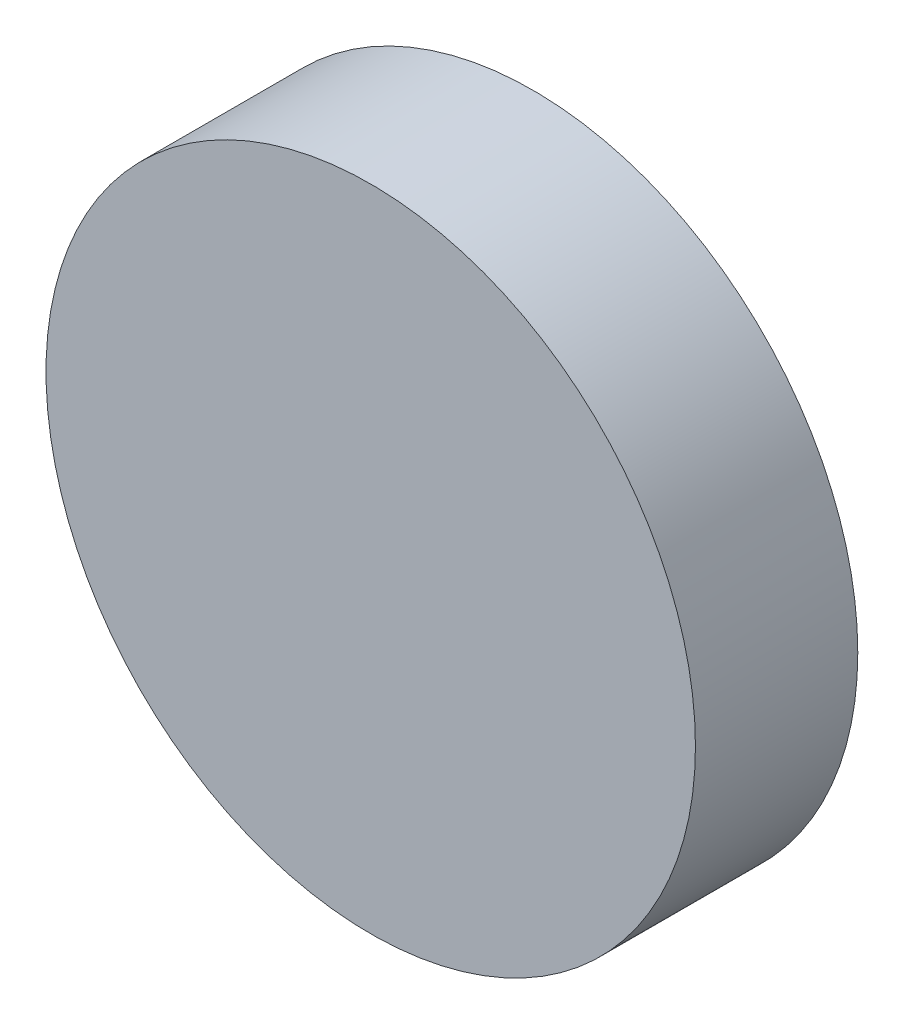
from build123d import *

# Parameters (mm, degrees)
EXTRUDE_160_40_DEPTH      = 20
EXTRUDE_160_40_DEPTH_BACK = 20
SKETCH_1_R                = 80


with BuildPart() as part:
    # Sketch 1 → Extrude 160 _ 40 (new, two sides: drawn at the far end of the back side and taken through both)
    with BuildSketch(Plane.XY.offset(-EXTRUDE_160_40_DEPTH_BACK)):
        Circle(SKETCH_1_R)
    extrude(amount=EXTRUDE_160_40_DEPTH + EXTRUDE_160_40_DEPTH_BACK)


solid = part.part
